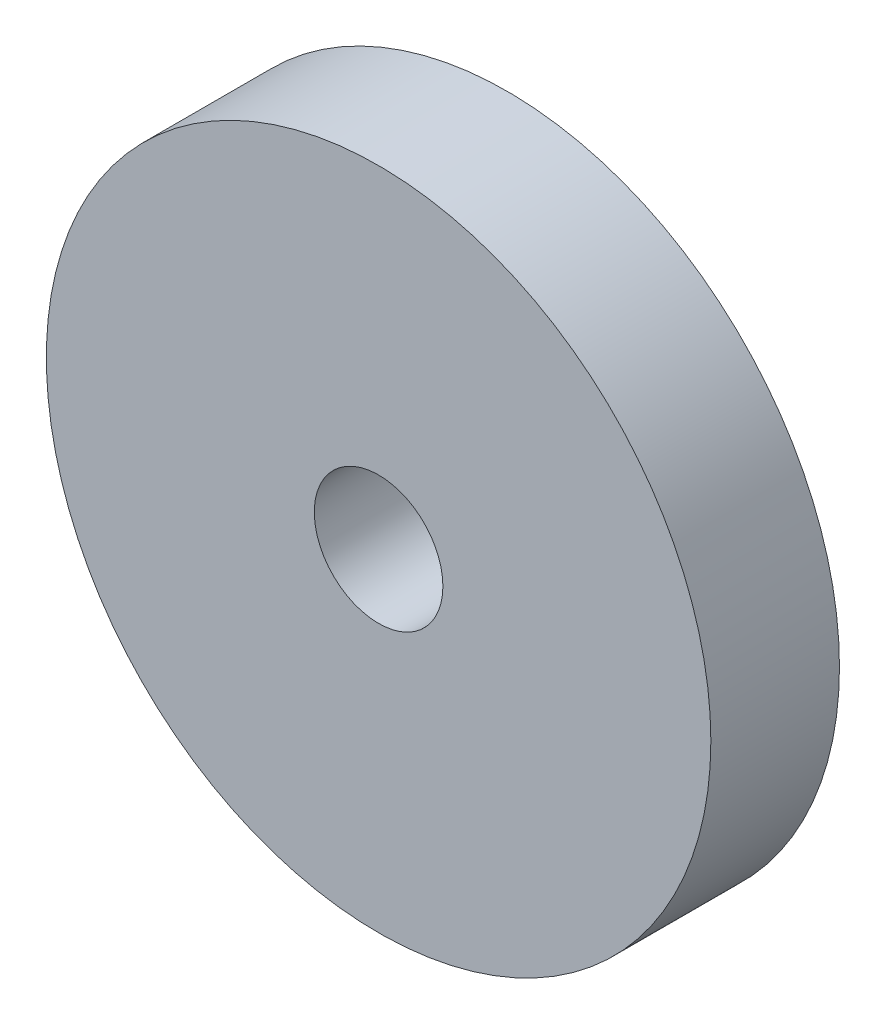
from build123d import *

# Parameters (mm, degrees)
SKETCH1_R           = 15.5
SKETCH1_R_2         = 3
BOSS_EXTRUDE1_DEPTH = 6


with BuildPart() as part:
    # Sketch1 → Boss-Extrude1 (new body)
    with BuildSketch(Plane.XY):
        Circle(SKETCH1_R)
        Circle(SKETCH1_R_2, mode=Mode.SUBTRACT)
    extrude(amount=BOSS_EXTRUDE1_DEPTH)


solid = part.part
